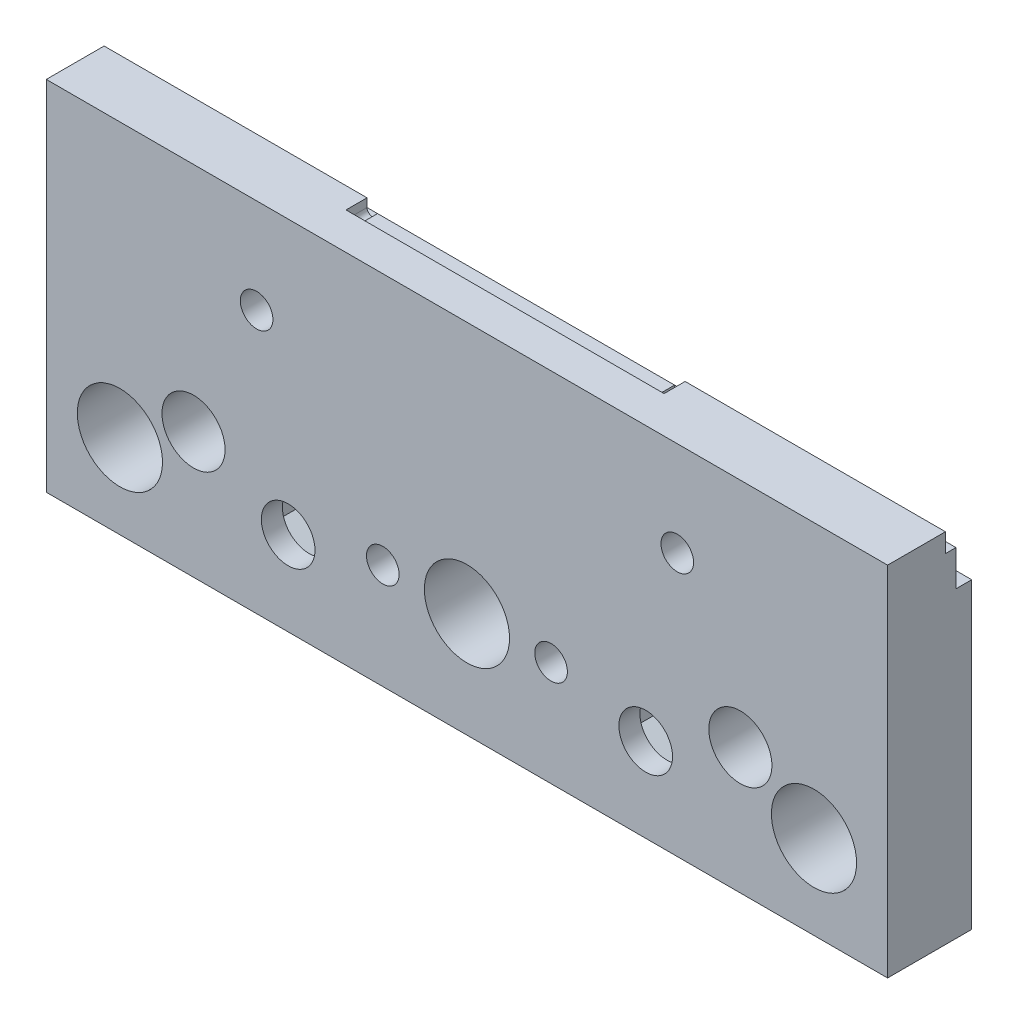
from build123d import *

# Parameters (mm, degrees)
SKETCH_2_W           = 80
SKETCH_2_H           = 34
SKETCH_2_R           = 4.05
EXTRUDE_1_DEPTH      = 8
SKETCH_3_R           = 2.55
CUT_EXTRUDE_1_DEPTH  = 88.292611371
CUT_EXTRUDE_2_DEPTH  = 88.292611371
SKETCH_5_R           = 1.55
CUT_EXTRUDE_3_DEPTH  = 88.292611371
CUT_EXTRUDE_15_DEPTH = 4.5
SKETCH_11_R          = 1.55
CUT_EXTRUDE_7_DEPTH  = 88.292611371
CUT_EXTRUDE_11_DEPTH = 2
SKETCH_21_R          = 3
CUT_EXTRUDE_13_DEPTH = 88.292611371
CUT_EXTRUDE_14_DEPTH = 6


with BuildPart() as part:
    # Sketch 2 → Extrude 1 (new body)
    with BuildSketch(Plane.XY):
        with Locations((40, 17)):
            Rectangle(SKETCH_2_W, SKETCH_2_H)
        with Locations((7, 8)):
            Circle(SKETCH_2_R, mode=Mode.SUBTRACT)
        with Locations((40, 10)):
            Circle(SKETCH_2_R, mode=Mode.SUBTRACT)
        with Locations((73, 8)):
            Circle(SKETCH_2_R, mode=Mode.SUBTRACT)
    extrude(amount=EXTRUDE_1_DEPTH)

    # Sketch 3 → Cut-Extrude 1 (cut, through all)
    with BuildSketch(Plane.XY.offset(8)):
        with Locations((23, 8)):
            Circle(SKETCH_3_R)
        with Locations((57, 8)):
            Circle(SKETCH_3_R)
    extrude(amount=-CUT_EXTRUDE_1_DEPTH, mode=Mode.SUBTRACT)

    # Sketch 4 → Cut-Extrude 2 (cut, through all)
    with BuildSketch(Plane(origin=(80, 0, 0), x_dir=(0, 0, -1), z_dir=(1, 0, 0))):
        Polygon((-1.5, 32.2), (-2.5, 32.2), (-2.5, 34), (0, 34), (0, 28.8), (-1.5, 28.8), align=None)
    extrude(amount=-CUT_EXTRUDE_2_DEPTH, mode=Mode.SUBTRACT)

    # Sketch 5 → Cut-Extrude 3 (cut, through all)
    with BuildSketch(Plane.XY.offset(8)):
        with Locations((48, 10)):
            Circle(SKETCH_5_R)
        with Locations((32, 10)):
            Circle(SKETCH_5_R)
    extrude(amount=-CUT_EXTRUDE_3_DEPTH, mode=Mode.SUBTRACT)

    # Sketch 8 → Cut-Extrude 15 (cut)
    with BuildSketch(Plane(origin=(0, 0, 0), x_dir=(-1, 0, 0), z_dir=(0, 0, -1))):
        Polygon((-48, 6.709103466), (-45.15, 8.354551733), (-45.15, 11.645448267), (-48, 13.290896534), (-50.85, 11.645448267), (-50.85, 8.354551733), align=None)
        Polygon((-34.85, 11.645448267), (-34.85, 8.354551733), (-32, 6.709103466), (-29.15, 8.354551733), (-29.15, 11.645448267), (-32, 13.290896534), align=None)
    extrude(amount=-CUT_EXTRUDE_15_DEPTH, mode=Mode.SUBTRACT)

    # Sketch 11 → Cut-Extrude 7 (cut, through all)
    with BuildSketch(Plane(origin=(0, 0, 0), x_dir=(-1, 0, 0), z_dir=(0, 0, -1))):
        with Locations((-60, 25)):
            Circle(SKETCH_11_R)
        with Locations((-20, 25)):
            Circle(SKETCH_11_R)
    extrude(amount=-CUT_EXTRUDE_7_DEPTH, mode=Mode.SUBTRACT)

    # Sketch 19 → Cut-Extrude 11 (cut)
    with BuildSketch(Plane(origin=(0, 0, 2.5), x_dir=(-1, 0, 0), z_dir=(0, 0, -1))):
        with BuildLine():
            Line((-25, 34), (-55.247938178, 34))
            Line((-55.247938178, 34), (-55.247938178, 33.2))
            ThreePointArc((-55.247938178, 33.2), (-54.747938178, 32.7), (-54.247938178, 33.2))
            Line((-54.247938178, 33.2), (-26, 33.2))
            ThreePointArc((-26, 33.2), (-25.5, 32.7), (-25, 33.2))
            Line((-25, 33.2), (-25, 34))
        make_face()
    extrude(amount=-CUT_EXTRUDE_11_DEPTH, mode=Mode.SUBTRACT)

    # Sketch 21 → Cut-Extrude 13 (cut, through all)
    with BuildSketch(Plane(origin=(0, 0, 0), x_dir=(-1, 0, 0), z_dir=(0, 0, -1))):
        with Locations((-66, 12)):
            Circle(SKETCH_21_R)
        with Locations(Location((-14, 12, 0), (0, 0, 180))):
            Circle(SKETCH_21_R)
    extrude(amount=-CUT_EXTRUDE_13_DEPTH, mode=Mode.SUBTRACT)

    # Sketch 22 → Cut-Extrude 14 (cut)
    with BuildSketch(Plane(origin=(0, 0, 0), x_dir=(-1, 0, 0), z_dir=(0, 0, -1))):
        Polygon((-52.9, 5.632863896), (-52.9, 10.367136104), (-57, 12.734272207), (-61.1, 10.367136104), (-61.1, 5.632863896), (-57, 3.265727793), align=None)
        Polygon((-23, 3.265727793), (-18.9, 5.632863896), (-18.9, 10.367136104), (-23, 12.734272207), (-27.1, 10.367136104), (-27.1, 5.632863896), align=None)
    extrude(amount=-CUT_EXTRUDE_14_DEPTH, mode=Mode.SUBTRACT)


solid = part.part
